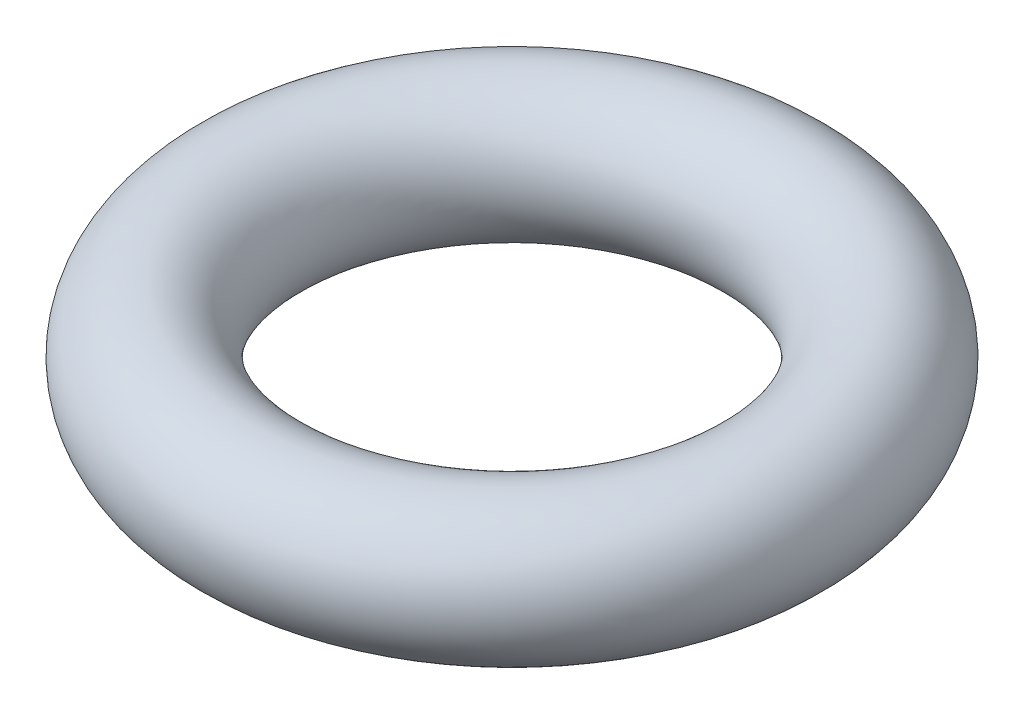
from build123d import *

# Parameters (mm, degrees)
SKETCH_3_R = 8


with BuildPart() as part:
    # Sweep 3: sweep along a path in Sketch 1
    with BuildLine(Plane(origin=(0, 0, 0), x_dir=(1, 0, 0), z_dir=(0, 1, 0))) as sweep_3_path:
        CenterArc((0, 0), 30, 0, 360)
    # Sketch 3 → Sweep 3 (sweep)
    with BuildSketch(Plane.XY):
        with Locations((-30, 0)):
            Circle(SKETCH_3_R)
    sweep(path=sweep_3_path.line)


solid = part.part
